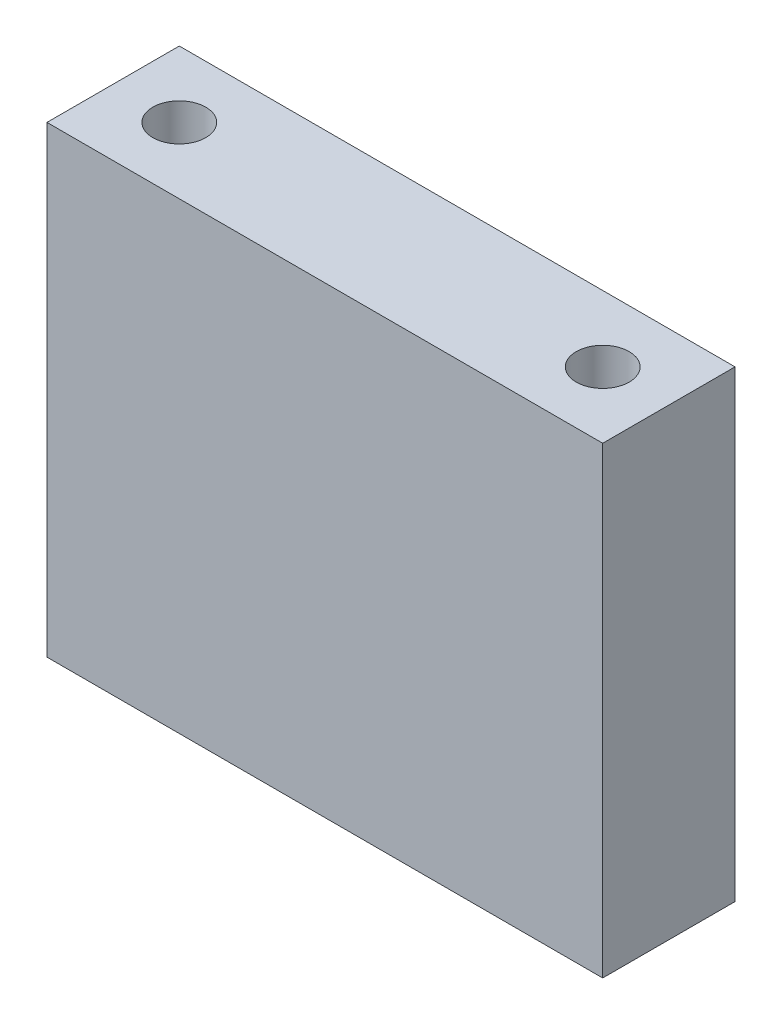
from build123d import *

# Parameters (mm, degrees)
SKETCH1_W           = 84
SKETCH1_H           = 20
SKETCH1_R           = 4
BOSS_EXTRUDE1_DEPTH = 70


with BuildPart() as part:
    # Sketch1 → Boss-Extrude1 (new body)
    with BuildSketch(Plane(origin=(0, 0, 0), x_dir=(1, 0, 0), z_dir=(0, 1, 0))):
        Rectangle(SKETCH1_W, SKETCH1_H)
        with Locations(Location((-32, 0, 0), (0, 0, 270))):
            Circle(SKETCH1_R, mode=Mode.SUBTRACT)
        with Locations(Location((32, 0, 0), (0, 0, 270))):
            Circle(SKETCH1_R, mode=Mode.SUBTRACT)
    extrude(amount=BOSS_EXTRUDE1_DEPTH)


solid = part.part
